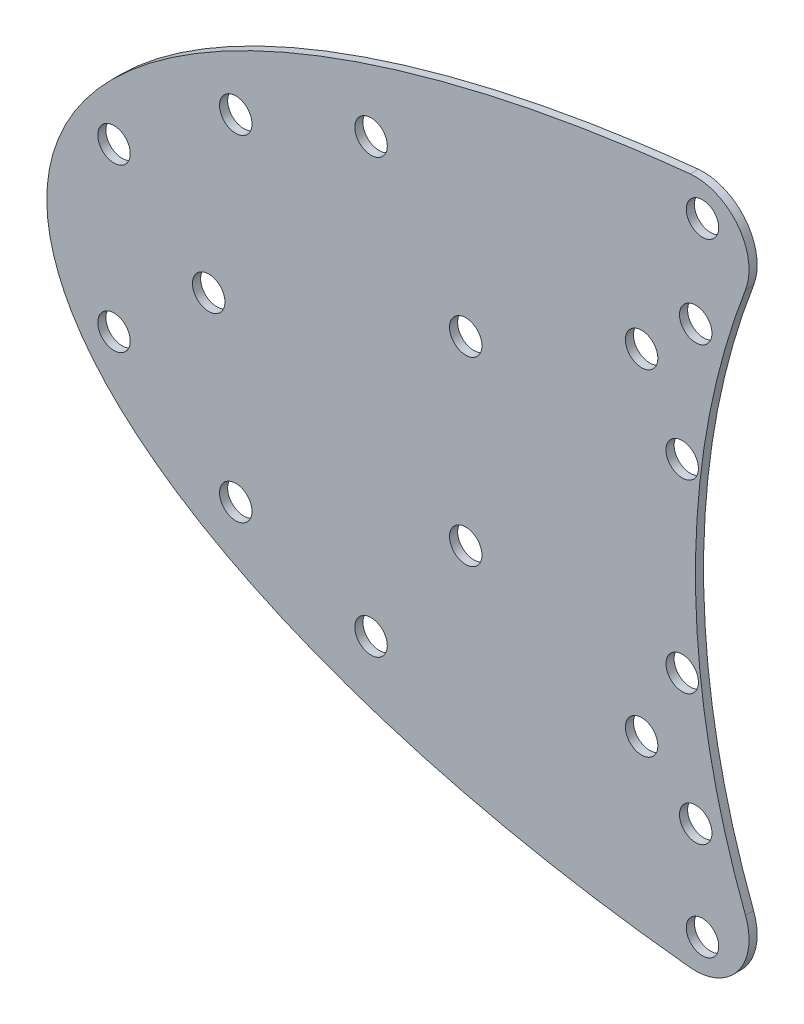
ISO-10303-21;
HEADER;
FILE_DESCRIPTION(('STEP AP214'),'2;1');
FILE_NAME('part.step','',(''),(''),'','','');
FILE_SCHEMA(('AUTOMOTIVE_DESIGN { 1 0 10303 214 1 1 1 1 }'));
ENDSEC;
DATA;
#1=APPLICATION_CONTEXT('core data for automotive mechanical design processes');
#2=APPLICATION_PROTOCOL_DEFINITION('international standard','automotive_design',2000,#1);
#3=PRODUCT_CONTEXT('',#1,'mechanical');
#4=PRODUCT('Part','Part','',(#3));
#5=PRODUCT_RELATED_PRODUCT_CATEGORY('part','',(#4));
#6=PRODUCT_DEFINITION_FORMATION('','',#4);
#7=PRODUCT_DEFINITION_CONTEXT('part definition',#1,'design');
#8=PRODUCT_DEFINITION('design','',#6,#7);
#9=PRODUCT_DEFINITION_SHAPE('','',#8);
#10=(LENGTH_UNIT() NAMED_UNIT(*) SI_UNIT(.MILLI.,.METRE.));
#11=(NAMED_UNIT(*) PLANE_ANGLE_UNIT() SI_UNIT($,.RADIAN.));
#12=(NAMED_UNIT(*) SI_UNIT($,.STERADIAN.) SOLID_ANGLE_UNIT());
#13=UNCERTAINTY_MEASURE_WITH_UNIT(LENGTH_MEASURE(1.E-05),#10,'distance_accuracy_value','');
#14=(GEOMETRIC_REPRESENTATION_CONTEXT(3) GLOBAL_UNCERTAINTY_ASSIGNED_CONTEXT((#13)) GLOBAL_UNIT_ASSIGNED_CONTEXT((#10,
#11,#12)) REPRESENTATION_CONTEXT('',''));
#15=CARTESIAN_POINT('',(0.,0.,0.));
#16=DIRECTION('',(0.,0.,1.));
#17=DIRECTION('',(1.,0.,0.));
#18=AXIS2_PLACEMENT_3D('',#15,#16,#17);
#19=CARTESIAN_POINT('',(-60.189081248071,107.21044141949,3.));
#20=DIRECTION('',(0.,0.,-1.));
#21=DIRECTION('',(-1.,0.,0.));
#22=AXIS2_PLACEMENT_3D('',#19,#20,#21);
#23=CYLINDRICAL_SURFACE('',#22,19.8953195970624);
#24=CARTESIAN_POINT('',(-60.189081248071,107.21044141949,0.));
#25=DIRECTION('',(0.,0.,-1.));
#26=DIRECTION('',(-1.,0.,0.));
#27=AXIS2_PLACEMENT_3D('',#24,#25,#26);
#28=CIRCLE('',#27,19.8953195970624);
#29=CARTESIAN_POINT('',(-62.0454838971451,127.018962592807,0.));
#30=VERTEX_POINT('',#29);
#31=CARTESIAN_POINT('',(-41.6075768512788,100.10048809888,0.));
#32=VERTEX_POINT('',#31);
#33=EDGE_CURVE('E101',#30,#32,#28,.T.);
#34=ORIENTED_EDGE('',*,*,#33,.F.);
#35=DIRECTION('',(0.,0.,-1.));
#36=VECTOR('',#35,1.);
#37=CARTESIAN_POINT('',(-62.0454838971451,127.018962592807,3.));
#38=LINE('',#37,#36);
#39=CARTESIAN_POINT('',(-62.0454838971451,127.018962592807,3.));
#40=VERTEX_POINT('',#39);
#41=EDGE_CURVE('E11',#40,#30,#38,.T.);
#42=ORIENTED_EDGE('',*,*,#41,.F.);
#43=CARTESIAN_POINT('',(-60.189081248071,107.21044141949,3.));
#44=DIRECTION('',(0.,0.,-1.));
#45=DIRECTION('',(-1.,0.,0.));
#46=AXIS2_PLACEMENT_3D('',#43,#44,#45);
#47=CIRCLE('',#46,19.8953195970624);
#48=CARTESIAN_POINT('',(-41.6075768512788,100.10048809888,3.));
#49=VERTEX_POINT('',#48);
#50=EDGE_CURVE('E93',#40,#49,#47,.T.);
#51=ORIENTED_EDGE('',*,*,#50,.T.);
#52=DIRECTION('',(0.,0.,-1.));
#53=VECTOR('',#52,1.);
#54=CARTESIAN_POINT('',(-41.6075768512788,100.10048809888,3.));
#55=LINE('',#54,#53);
#56=EDGE_CURVE('E38',#49,#32,#55,.T.);
#57=ORIENTED_EDGE('',*,*,#56,.T.);
#58=EDGE_LOOP('',(#34,#42,#51,#57));
#59=FACE_BOUND('',#58,.T.);
#60=ADVANCED_FACE('F35',(#59),#23,.T.);
#61=CARTESIAN_POINT('',(11.9501771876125,0.000386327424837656,3.));
#62=DIRECTION('',(0.,0.,-1.));
#63=DIRECTION('',(0.999999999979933,6.33512977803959E-06,0.));
#64=AXIS2_PLACEMENT_3D('',#61,#62,#63);
#65=ELLIPSE('',#64,311.78613987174,130.754687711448);
#66=DIRECTION('',(0.,0.,-1.));
#67=VECTOR('',#66,1.);
#68=SURFACE_OF_LINEAR_EXTRUSION('',#65,#67);
#69=CARTESIAN_POINT('',(11.9501771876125,0.000386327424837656,0.));
#70=DIRECTION('',(0.,0.,-1.));
#71=DIRECTION('',(0.999999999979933,6.33512977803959E-06,0.));
#72=AXIS2_PLACEMENT_3D('',#69,#70,#71);
#73=ELLIPSE('',#72,311.78613987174,130.754687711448);
#74=CARTESIAN_POINT('',(-62.0454838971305,-127.018962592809,0.));
#75=VERTEX_POINT('',#74);
#76=EDGE_CURVE('E95',#75,#30,#73,.T.);
#77=ORIENTED_EDGE('',*,*,#76,.F.);
#78=DIRECTION('',(0.,0.,-1.));
#79=VECTOR('',#78,1.);
#80=CARTESIAN_POINT('',(-62.0454838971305,-127.018962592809,3.));
#81=LINE('',#80,#79);
#82=CARTESIAN_POINT('',(-62.0454838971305,-127.018962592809,3.));
#83=VERTEX_POINT('',#82);
#84=EDGE_CURVE('E44',#83,#75,#81,.T.);
#85=ORIENTED_EDGE('',*,*,#84,.F.);
#86=EDGE_CURVE('E90',#83,#40,#65,.T.);
#87=ORIENTED_EDGE('',*,*,#86,.T.);
#88=ORIENTED_EDGE('',*,*,#41,.T.);
#89=EDGE_LOOP('',(#77,#85,#87,#88));
#90=FACE_BOUND('',#89,.T.);
#91=ADVANCED_FACE('F104',(#90),#68,.T.);
#92=CARTESIAN_POINT('',(-60.1890812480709,-107.21044141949,3.));
#93=DIRECTION('',(0.,0.,-1.));
#94=DIRECTION('',(-1.,0.,0.));
#95=AXIS2_PLACEMENT_3D('',#92,#93,#94);
#96=CYLINDRICAL_SURFACE('',#95,19.8953195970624);
#97=CARTESIAN_POINT('',(-60.1890812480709,-107.21044141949,0.));
#98=DIRECTION('',(0.,0.,-1.));
#99=DIRECTION('',(-1.,0.,0.));
#100=AXIS2_PLACEMENT_3D('',#97,#98,#99);
#101=CIRCLE('',#100,19.8953195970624);
#102=CARTESIAN_POINT('',(-41.6075768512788,-100.10048809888,0.));
#103=VERTEX_POINT('',#102);
#104=EDGE_CURVE('E85',#103,#75,#101,.T.);
#105=ORIENTED_EDGE('',*,*,#104,.F.);
#106=DIRECTION('',(0.,0.,-1.));
#107=VECTOR('',#106,1.);
#108=CARTESIAN_POINT('',(-41.6075768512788,-100.10048809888,3.));
#109=LINE('',#108,#107);
#110=CARTESIAN_POINT('',(-41.6075768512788,-100.10048809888,3.));
#111=VERTEX_POINT('',#110);
#112=EDGE_CURVE('E80',#111,#103,#109,.T.);
#113=ORIENTED_EDGE('',*,*,#112,.F.);
#114=CARTESIAN_POINT('',(-60.1890812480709,-107.21044141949,3.));
#115=DIRECTION('',(0.,0.,-1.));
#116=DIRECTION('',(-1.,0.,0.));
#117=AXIS2_PLACEMENT_3D('',#114,#115,#116);
#118=CIRCLE('',#117,19.8953195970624);
#119=EDGE_CURVE('E83',#111,#83,#118,.T.);
#120=ORIENTED_EDGE('',*,*,#119,.T.);
#121=ORIENTED_EDGE('',*,*,#84,.T.);
#122=EDGE_LOOP('',(#105,#113,#120,#121));
#123=FACE_BOUND('',#122,.T.);
#124=ADVANCED_FACE('F82',(#123),#96,.T.);
#125=CARTESIAN_POINT('',(220.,0.,3.));
#126=DIRECTION('',(0.,0.,-1.));
#127=DIRECTION('',(-1.,0.,0.));
#128=AXIS2_PLACEMENT_3D('',#125,#126,#127);
#129=CYLINDRICAL_SURFACE('',#128,280.104680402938);
#130=CARTESIAN_POINT('',(220.,0.,0.));
#131=DIRECTION('',(0.,0.,1.));
#132=DIRECTION('',(1.,0.,0.));
#133=AXIS2_PLACEMENT_3D('',#130,#131,#132);
#134=CIRCLE('',#133,280.104680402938);
#135=EDGE_CURVE('E122',#32,#103,#134,.T.);
#136=ORIENTED_EDGE('',*,*,#135,.F.);
#137=ORIENTED_EDGE('',*,*,#56,.F.);
#138=CARTESIAN_POINT('',(220.,0.,3.));
#139=DIRECTION('',(0.,0.,1.));
#140=DIRECTION('',(1.,0.,0.));
#141=AXIS2_PLACEMENT_3D('',#138,#139,#140);
#142=CIRCLE('',#141,280.104680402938);
#143=EDGE_CURVE('E89',#49,#111,#142,.T.);
#144=ORIENTED_EDGE('',*,*,#143,.T.);
#145=ORIENTED_EDGE('',*,*,#112,.T.);
#146=EDGE_LOOP('',(#136,#137,#144,#145));
#147=FACE_BOUND('',#146,.T.);
#148=ADVANCED_FACE('F92',(#147),#129,.F.);
#149=CARTESIAN_POINT('',(11.9501771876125,0.000386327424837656,3.));
#150=DIRECTION('',(0.,0.,-1.));
#151=DIRECTION('',(-1.,0.,0.));
#152=AXIS2_PLACEMENT_3D('',#149,#150,#151);
#153=PLANE('',#152);
#154=CARTESIAN_POINT('',(-57.5,115.,3.));
#155=DIRECTION('',(0.,0.,-1.));
#156=DIRECTION('',(1.,0.,0.));
#157=AXIS2_PLACEMENT_3D('',#154,#155,#156);
#158=CIRCLE('',#157,6.00000000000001);
#159=CARTESIAN_POINT('',(-51.5,115.,3.));
#160=VERTEX_POINT('',#159);
#161=EDGE_CURVE('E265',#160,#160,#158,.T.);
#162=ORIENTED_EDGE('',*,*,#161,.T.);
#163=EDGE_LOOP('',(#162));
#164=FACE_BOUND('',#163,.T.);
#165=CARTESIAN_POINT('',(-57.5,-115.,3.));
#166=DIRECTION('',(0.,0.,-1.));
#167=DIRECTION('',(1.,0.,0.));
#168=AXIS2_PLACEMENT_3D('',#165,#166,#167);
#169=CIRCLE('',#168,6.00000000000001);
#170=CARTESIAN_POINT('',(-51.5,-115.,3.));
#171=VERTEX_POINT('',#170);
#172=EDGE_CURVE('E261',#171,#171,#169,.T.);
#173=ORIENTED_EDGE('',*,*,#172,.T.);
#174=EDGE_LOOP('',(#173));
#175=FACE_BOUND('',#174,.T.);
#176=CARTESIAN_POINT('',(-80.,-62.,3.));
#177=DIRECTION('',(0.,0.,-1.));
#178=DIRECTION('',(1.,0.,0.));
#179=AXIS2_PLACEMENT_3D('',#176,#177,#178);
#180=CIRCLE('',#179,6.00000000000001);
#181=CARTESIAN_POINT('',(-74.,-62.,3.));
#182=VERTEX_POINT('',#181);
#183=EDGE_CURVE('E257',#182,#182,#180,.T.);
#184=ORIENTED_EDGE('',*,*,#183,.T.);
#185=EDGE_LOOP('',(#184));
#186=FACE_BOUND('',#185,.T.);
#187=CARTESIAN_POINT('',(-60.0000000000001,-80.,3.));
#188=DIRECTION('',(0.,0.,-1.));
#189=DIRECTION('',(1.,0.,0.));
#190=AXIS2_PLACEMENT_3D('',#187,#188,#189);
#191=CIRCLE('',#190,6.00000000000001);
#192=CARTESIAN_POINT('',(-54.0000000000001,-80.,3.));
#193=VERTEX_POINT('',#192);
#194=EDGE_CURVE('E253',#193,#193,#191,.T.);
#195=ORIENTED_EDGE('',*,*,#194,.T.);
#196=EDGE_LOOP('',(#195));
#197=FACE_BOUND('',#196,.T.);
#198=CARTESIAN_POINT('',(-60.0000000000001,80.,3.));
#199=DIRECTION('',(0.,0.,-1.));
#200=DIRECTION('',(1.,0.,0.));
#201=AXIS2_PLACEMENT_3D('',#198,#199,#200);
#202=CIRCLE('',#201,6.00000000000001);
#203=CARTESIAN_POINT('',(-54.0000000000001,80.,3.));
#204=VERTEX_POINT('',#203);
#205=EDGE_CURVE('E249',#204,#204,#202,.T.);
#206=ORIENTED_EDGE('',*,*,#205,.T.);
#207=EDGE_LOOP('',(#206));
#208=FACE_BOUND('',#207,.T.);
#209=CARTESIAN_POINT('',(-80.,62.,3.));
#210=DIRECTION('',(0.,0.,-1.));
#211=DIRECTION('',(1.,0.,0.));
#212=AXIS2_PLACEMENT_3D('',#209,#210,#211);
#213=CIRCLE('',#212,6.00000000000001);
#214=CARTESIAN_POINT('',(-74.,62.,3.));
#215=VERTEX_POINT('',#214);
#216=EDGE_CURVE('E245',#215,#215,#213,.T.);
#217=ORIENTED_EDGE('',*,*,#216,.T.);
#218=EDGE_LOOP('',(#217));
#219=FACE_BOUND('',#218,.T.);
#220=CARTESIAN_POINT('',(-65.,-34.2,3.));
#221=DIRECTION('',(0.,0.,-1.));
#222=DIRECTION('',(1.,0.,0.));
#223=AXIS2_PLACEMENT_3D('',#220,#221,#222);
#224=CIRCLE('',#223,6.00000000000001);
#225=CARTESIAN_POINT('',(-59.,-34.2,3.));
#226=VERTEX_POINT('',#225);
#227=EDGE_CURVE('E241',#226,#226,#224,.T.);
#228=ORIENTED_EDGE('',*,*,#227,.T.);
#229=EDGE_LOOP('',(#228));
#230=FACE_BOUND('',#229,.T.);
#231=CARTESIAN_POINT('',(-145.,33.5,3.));
#232=DIRECTION('',(0.,0.,-1.));
#233=DIRECTION('',(1.,0.,0.));
#234=AXIS2_PLACEMENT_3D('',#231,#232,#233);
#235=CIRCLE('',#234,6.00000000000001);
#236=CARTESIAN_POINT('',(-139.,33.5,3.));
#237=VERTEX_POINT('',#236);
#238=EDGE_CURVE('E237',#237,#237,#235,.T.);
#239=ORIENTED_EDGE('',*,*,#238,.T.);
#240=EDGE_LOOP('',(#239));
#241=FACE_BOUND('',#240,.T.);
#242=CARTESIAN_POINT('',(-65.,34.2,3.));
#243=DIRECTION('',(0.,0.,-1.));
#244=DIRECTION('',(1.,0.,0.));
#245=AXIS2_PLACEMENT_3D('',#242,#243,#244);
#246=CIRCLE('',#245,6.00000000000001);
#247=CARTESIAN_POINT('',(-59.,34.2,3.));
#248=VERTEX_POINT('',#247);
#249=EDGE_CURVE('E233',#248,#248,#246,.T.);
#250=ORIENTED_EDGE('',*,*,#249,.T.);
#251=EDGE_LOOP('',(#250));
#252=FACE_BOUND('',#251,.T.);
#253=CARTESIAN_POINT('',(-145.,-33.5,3.));
#254=DIRECTION('',(0.,0.,-1.));
#255=DIRECTION('',(1.,0.,0.));
#256=AXIS2_PLACEMENT_3D('',#253,#254,#255);
#257=CIRCLE('',#256,6.00000000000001);
#258=CARTESIAN_POINT('',(-139.,-33.5,3.));
#259=VERTEX_POINT('',#258);
#260=EDGE_CURVE('E229',#259,#259,#257,.T.);
#261=ORIENTED_EDGE('',*,*,#260,.T.);
#262=EDGE_LOOP('',(#261));
#263=FACE_BOUND('',#262,.T.);
#264=CARTESIAN_POINT('',(-180.,-80.,3.));
#265=DIRECTION('',(0.,0.,-1.));
#266=DIRECTION('',(1.,0.,0.));
#267=AXIS2_PLACEMENT_3D('',#264,#265,#266);
#268=CIRCLE('',#267,6.00000000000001);
#269=CARTESIAN_POINT('',(-174.,-80.,3.));
#270=VERTEX_POINT('',#269);
#271=EDGE_CURVE('E225',#270,#270,#268,.T.);
#272=ORIENTED_EDGE('',*,*,#271,.T.);
#273=EDGE_LOOP('',(#272));
#274=FACE_BOUND('',#273,.T.);
#275=CARTESIAN_POINT('',(-180.,80.,3.));
#276=DIRECTION('',(0.,0.,-1.));
#277=DIRECTION('',(1.,0.,0.));
#278=AXIS2_PLACEMENT_3D('',#275,#276,#277);
#279=CIRCLE('',#278,6.00000000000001);
#280=CARTESIAN_POINT('',(-174.,80.,3.));
#281=VERTEX_POINT('',#280);
#282=EDGE_CURVE('E221',#281,#281,#279,.T.);
#283=ORIENTED_EDGE('',*,*,#282,.T.);
#284=EDGE_LOOP('',(#283));
#285=FACE_BOUND('',#284,.T.);
#286=CARTESIAN_POINT('',(-230.,-62.,3.));
#287=DIRECTION('',(0.,0.,-1.));
#288=DIRECTION('',(1.,0.,0.));
#289=AXIS2_PLACEMENT_3D('',#286,#287,#288);
#290=CIRCLE('',#289,6.00000000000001);
#291=CARTESIAN_POINT('',(-224.,-62.,3.));
#292=VERTEX_POINT('',#291);
#293=EDGE_CURVE('E217',#292,#292,#290,.T.);
#294=ORIENTED_EDGE('',*,*,#293,.T.);
#295=EDGE_LOOP('',(#294));
#296=FACE_BOUND('',#295,.T.);
#297=CARTESIAN_POINT('',(-230.,62.,3.));
#298=DIRECTION('',(0.,0.,-1.));
#299=DIRECTION('',(1.,0.,0.));
#300=AXIS2_PLACEMENT_3D('',#297,#298,#299);
#301=CIRCLE('',#300,6.00000000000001);
#302=CARTESIAN_POINT('',(-224.,62.,3.));
#303=VERTEX_POINT('',#302);
#304=EDGE_CURVE('E213',#303,#303,#301,.T.);
#305=ORIENTED_EDGE('',*,*,#304,.T.);
#306=EDGE_LOOP('',(#305));
#307=FACE_BOUND('',#306,.T.);
#308=CARTESIAN_POINT('',(-240.,0.,3.));
#309=DIRECTION('',(0.,0.,-1.));
#310=DIRECTION('',(1.,0.,0.));
#311=AXIS2_PLACEMENT_3D('',#308,#309,#310);
#312=CIRCLE('',#311,6.00000000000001);
#313=CARTESIAN_POINT('',(-234.,0.,3.));
#314=VERTEX_POINT('',#313);
#315=EDGE_CURVE('E210',#314,#314,#312,.T.);
#316=ORIENTED_EDGE('',*,*,#315,.T.);
#317=EDGE_LOOP('',(#316));
#318=FACE_BOUND('',#317,.T.);
#319=CARTESIAN_POINT('',(-275.,30.,3.));
#320=DIRECTION('',(0.,0.,-1.));
#321=DIRECTION('',(1.,0.,0.));
#322=AXIS2_PLACEMENT_3D('',#319,#320,#321);
#323=CIRCLE('',#322,6.00000000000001);
#324=CARTESIAN_POINT('',(-269.,30.,3.));
#325=VERTEX_POINT('',#324);
#326=EDGE_CURVE('E204',#325,#325,#323,.T.);
#327=ORIENTED_EDGE('',*,*,#326,.T.);
#328=EDGE_LOOP('',(#327));
#329=FACE_BOUND('',#328,.T.);
#330=CARTESIAN_POINT('',(-275.,-30.,3.));
#331=DIRECTION('',(0.,0.,-1.));
#332=DIRECTION('',(1.,0.,0.));
#333=AXIS2_PLACEMENT_3D('',#330,#331,#332);
#334=CIRCLE('',#333,6.00000000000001);
#335=CARTESIAN_POINT('',(-269.,-30.,3.));
#336=VERTEX_POINT('',#335);
#337=EDGE_CURVE('E123',#336,#336,#334,.T.);
#338=ORIENTED_EDGE('',*,*,#337,.T.);
#339=EDGE_LOOP('',(#338));
#340=FACE_BOUND('',#339,.T.);
#341=ORIENTED_EDGE('',*,*,#50,.F.);
#342=ORIENTED_EDGE('',*,*,#86,.F.);
#343=ORIENTED_EDGE('',*,*,#119,.F.);
#344=ORIENTED_EDGE('',*,*,#143,.F.);
#345=EDGE_LOOP('',(#341,#342,#343,#344));
#346=FACE_BOUND('',#345,.T.);
#347=ADVANCED_FACE('F88',(#164,#175,#186,#197,#208,#219,#230,#241,#252,#263,#274,#285,#296,#307,
#318,#329,#340,#346),#153,.F.);
#348=CARTESIAN_POINT('',(11.9501771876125,0.000386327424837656,0.));
#349=DIRECTION('',(0.,0.,-1.));
#350=DIRECTION('',(-1.,0.,0.));
#351=AXIS2_PLACEMENT_3D('',#348,#349,#350);
#352=PLANE('',#351);
#353=CARTESIAN_POINT('',(-57.5,115.,0.));
#354=DIRECTION('',(0.,0.,-1.));
#355=DIRECTION('',(1.,0.,0.));
#356=AXIS2_PLACEMENT_3D('',#353,#354,#355);
#357=CIRCLE('',#356,6.00000000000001);
#358=CARTESIAN_POINT('',(-51.5,115.,0.));
#359=VERTEX_POINT('',#358);
#360=EDGE_CURVE('E139',#359,#359,#357,.T.);
#361=ORIENTED_EDGE('',*,*,#360,.F.);
#362=EDGE_LOOP('',(#361));
#363=FACE_BOUND('',#362,.T.);
#364=CARTESIAN_POINT('',(-57.5,-115.,0.));
#365=DIRECTION('',(0.,0.,-1.));
#366=DIRECTION('',(1.,0.,0.));
#367=AXIS2_PLACEMENT_3D('',#364,#365,#366);
#368=CIRCLE('',#367,6.00000000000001);
#369=CARTESIAN_POINT('',(-51.5,-115.,0.));
#370=VERTEX_POINT('',#369);
#371=EDGE_CURVE('E143',#370,#370,#368,.T.);
#372=ORIENTED_EDGE('',*,*,#371,.F.);
#373=EDGE_LOOP('',(#372));
#374=FACE_BOUND('',#373,.T.);
#375=CARTESIAN_POINT('',(-80.,-62.,0.));
#376=DIRECTION('',(0.,0.,-1.));
#377=DIRECTION('',(1.,0.,0.));
#378=AXIS2_PLACEMENT_3D('',#375,#376,#377);
#379=CIRCLE('',#378,6.00000000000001);
#380=CARTESIAN_POINT('',(-74.,-62.,0.));
#381=VERTEX_POINT('',#380);
#382=EDGE_CURVE('E147',#381,#381,#379,.T.);
#383=ORIENTED_EDGE('',*,*,#382,.F.);
#384=EDGE_LOOP('',(#383));
#385=FACE_BOUND('',#384,.T.);
#386=CARTESIAN_POINT('',(-60.0000000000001,-80.,0.));
#387=DIRECTION('',(0.,0.,-1.));
#388=DIRECTION('',(1.,0.,0.));
#389=AXIS2_PLACEMENT_3D('',#386,#387,#388);
#390=CIRCLE('',#389,6.00000000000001);
#391=CARTESIAN_POINT('',(-54.0000000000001,-80.,0.));
#392=VERTEX_POINT('',#391);
#393=EDGE_CURVE('E151',#392,#392,#390,.T.);
#394=ORIENTED_EDGE('',*,*,#393,.F.);
#395=EDGE_LOOP('',(#394));
#396=FACE_BOUND('',#395,.T.);
#397=CARTESIAN_POINT('',(-60.0000000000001,80.,0.));
#398=DIRECTION('',(0.,0.,-1.));
#399=DIRECTION('',(1.,0.,0.));
#400=AXIS2_PLACEMENT_3D('',#397,#398,#399);
#401=CIRCLE('',#400,6.00000000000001);
#402=CARTESIAN_POINT('',(-54.0000000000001,80.,0.));
#403=VERTEX_POINT('',#402);
#404=EDGE_CURVE('E155',#403,#403,#401,.T.);
#405=ORIENTED_EDGE('',*,*,#404,.F.);
#406=EDGE_LOOP('',(#405));
#407=FACE_BOUND('',#406,.T.);
#408=CARTESIAN_POINT('',(-80.,62.,0.));
#409=DIRECTION('',(0.,0.,-1.));
#410=DIRECTION('',(1.,0.,0.));
#411=AXIS2_PLACEMENT_3D('',#408,#409,#410);
#412=CIRCLE('',#411,6.00000000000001);
#413=CARTESIAN_POINT('',(-74.,62.,0.));
#414=VERTEX_POINT('',#413);
#415=EDGE_CURVE('E159',#414,#414,#412,.T.);
#416=ORIENTED_EDGE('',*,*,#415,.F.);
#417=EDGE_LOOP('',(#416));
#418=FACE_BOUND('',#417,.T.);
#419=CARTESIAN_POINT('',(-65.,-34.2,0.));
#420=DIRECTION('',(0.,0.,-1.));
#421=DIRECTION('',(1.,0.,0.));
#422=AXIS2_PLACEMENT_3D('',#419,#420,#421);
#423=CIRCLE('',#422,6.00000000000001);
#424=CARTESIAN_POINT('',(-59.,-34.2,0.));
#425=VERTEX_POINT('',#424);
#426=EDGE_CURVE('E163',#425,#425,#423,.T.);
#427=ORIENTED_EDGE('',*,*,#426,.F.);
#428=EDGE_LOOP('',(#427));
#429=FACE_BOUND('',#428,.T.);
#430=CARTESIAN_POINT('',(-145.,33.5,0.));
#431=DIRECTION('',(0.,0.,-1.));
#432=DIRECTION('',(1.,0.,0.));
#433=AXIS2_PLACEMENT_3D('',#430,#431,#432);
#434=CIRCLE('',#433,6.00000000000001);
#435=CARTESIAN_POINT('',(-139.,33.5,0.));
#436=VERTEX_POINT('',#435);
#437=EDGE_CURVE('E167',#436,#436,#434,.T.);
#438=ORIENTED_EDGE('',*,*,#437,.F.);
#439=EDGE_LOOP('',(#438));
#440=FACE_BOUND('',#439,.T.);
#441=CARTESIAN_POINT('',(-65.,34.2,0.));
#442=DIRECTION('',(0.,0.,-1.));
#443=DIRECTION('',(1.,0.,0.));
#444=AXIS2_PLACEMENT_3D('',#441,#442,#443);
#445=CIRCLE('',#444,6.00000000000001);
#446=CARTESIAN_POINT('',(-59.,34.2,0.));
#447=VERTEX_POINT('',#446);
#448=EDGE_CURVE('E171',#447,#447,#445,.T.);
#449=ORIENTED_EDGE('',*,*,#448,.F.);
#450=EDGE_LOOP('',(#449));
#451=FACE_BOUND('',#450,.T.);
#452=CARTESIAN_POINT('',(-145.,-33.5,0.));
#453=DIRECTION('',(0.,0.,-1.));
#454=DIRECTION('',(1.,0.,0.));
#455=AXIS2_PLACEMENT_3D('',#452,#453,#454);
#456=CIRCLE('',#455,6.00000000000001);
#457=CARTESIAN_POINT('',(-139.,-33.5,0.));
#458=VERTEX_POINT('',#457);
#459=EDGE_CURVE('E175',#458,#458,#456,.T.);
#460=ORIENTED_EDGE('',*,*,#459,.F.);
#461=EDGE_LOOP('',(#460));
#462=FACE_BOUND('',#461,.T.);
#463=CARTESIAN_POINT('',(-180.,-80.,0.));
#464=DIRECTION('',(0.,0.,-1.));
#465=DIRECTION('',(1.,0.,0.));
#466=AXIS2_PLACEMENT_3D('',#463,#464,#465);
#467=CIRCLE('',#466,6.00000000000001);
#468=CARTESIAN_POINT('',(-174.,-80.,0.));
#469=VERTEX_POINT('',#468);
#470=EDGE_CURVE('E179',#469,#469,#467,.T.);
#471=ORIENTED_EDGE('',*,*,#470,.F.);
#472=EDGE_LOOP('',(#471));
#473=FACE_BOUND('',#472,.T.);
#474=CARTESIAN_POINT('',(-180.,80.,0.));
#475=DIRECTION('',(0.,0.,-1.));
#476=DIRECTION('',(1.,0.,0.));
#477=AXIS2_PLACEMENT_3D('',#474,#475,#476);
#478=CIRCLE('',#477,6.00000000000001);
#479=CARTESIAN_POINT('',(-174.,80.,0.));
#480=VERTEX_POINT('',#479);
#481=EDGE_CURVE('E183',#480,#480,#478,.T.);
#482=ORIENTED_EDGE('',*,*,#481,.F.);
#483=EDGE_LOOP('',(#482));
#484=FACE_BOUND('',#483,.T.);
#485=CARTESIAN_POINT('',(-230.,-62.,0.));
#486=DIRECTION('',(0.,0.,-1.));
#487=DIRECTION('',(1.,0.,0.));
#488=AXIS2_PLACEMENT_3D('',#485,#486,#487);
#489=CIRCLE('',#488,6.00000000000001);
#490=CARTESIAN_POINT('',(-224.,-62.,0.));
#491=VERTEX_POINT('',#490);
#492=EDGE_CURVE('E187',#491,#491,#489,.T.);
#493=ORIENTED_EDGE('',*,*,#492,.F.);
#494=EDGE_LOOP('',(#493));
#495=FACE_BOUND('',#494,.T.);
#496=CARTESIAN_POINT('',(-230.,62.,0.));
#497=DIRECTION('',(0.,0.,-1.));
#498=DIRECTION('',(1.,0.,0.));
#499=AXIS2_PLACEMENT_3D('',#496,#497,#498);
#500=CIRCLE('',#499,6.00000000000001);
#501=CARTESIAN_POINT('',(-224.,62.,0.));
#502=VERTEX_POINT('',#501);
#503=EDGE_CURVE('E191',#502,#502,#500,.T.);
#504=ORIENTED_EDGE('',*,*,#503,.F.);
#505=EDGE_LOOP('',(#504));
#506=FACE_BOUND('',#505,.T.);
#507=CARTESIAN_POINT('',(-240.,0.,0.));
#508=DIRECTION('',(0.,0.,-1.));
#509=DIRECTION('',(1.,0.,0.));
#510=AXIS2_PLACEMENT_3D('',#507,#508,#509);
#511=CIRCLE('',#510,6.00000000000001);
#512=CARTESIAN_POINT('',(-234.,0.,0.));
#513=VERTEX_POINT('',#512);
#514=EDGE_CURVE('E195',#513,#513,#511,.T.);
#515=ORIENTED_EDGE('',*,*,#514,.F.);
#516=EDGE_LOOP('',(#515));
#517=FACE_BOUND('',#516,.T.);
#518=CARTESIAN_POINT('',(-275.,30.,0.));
#519=DIRECTION('',(0.,0.,-1.));
#520=DIRECTION('',(1.,0.,0.));
#521=AXIS2_PLACEMENT_3D('',#518,#519,#520);
#522=CIRCLE('',#521,6.00000000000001);
#523=CARTESIAN_POINT('',(-269.,30.,0.));
#524=VERTEX_POINT('',#523);
#525=EDGE_CURVE('E199',#524,#524,#522,.T.);
#526=ORIENTED_EDGE('',*,*,#525,.F.);
#527=EDGE_LOOP('',(#526));
#528=FACE_BOUND('',#527,.T.);
#529=CARTESIAN_POINT('',(-275.,-30.,0.));
#530=DIRECTION('',(0.,0.,-1.));
#531=DIRECTION('',(1.,0.,0.));
#532=AXIS2_PLACEMENT_3D('',#529,#530,#531);
#533=CIRCLE('',#532,6.00000000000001);
#534=CARTESIAN_POINT('',(-269.,-30.,0.));
#535=VERTEX_POINT('',#534);
#536=EDGE_CURVE('E202',#535,#535,#533,.T.);
#537=ORIENTED_EDGE('',*,*,#536,.F.);
#538=EDGE_LOOP('',(#537));
#539=FACE_BOUND('',#538,.T.);
#540=ORIENTED_EDGE('',*,*,#33,.T.);
#541=ORIENTED_EDGE('',*,*,#135,.T.);
#542=ORIENTED_EDGE('',*,*,#104,.T.);
#543=ORIENTED_EDGE('',*,*,#76,.T.);
#544=EDGE_LOOP('',(#540,#541,#542,#543));
#545=FACE_BOUND('',#544,.T.);
#546=ADVANCED_FACE('F108',(#363,#374,#385,#396,#407,#418,#429,#440,#451,#462,#473,#484,#495,
#506,#517,#528,#539,#545),#352,.T.);
#547=CARTESIAN_POINT('',(-275.,-30.,3.));
#548=DIRECTION('',(0.,0.,-1.));
#549=DIRECTION('',(-1.,0.,0.));
#550=AXIS2_PLACEMENT_3D('',#547,#548,#549);
#551=CYLINDRICAL_SURFACE('',#550,6.00000000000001);
#552=ORIENTED_EDGE('',*,*,#337,.F.);
#553=EDGE_LOOP('',(#552));
#554=FACE_BOUND('',#553,.T.);
#555=ORIENTED_EDGE('',*,*,#536,.T.);
#556=EDGE_LOOP('',(#555));
#557=FACE_BOUND('',#556,.T.);
#558=ADVANCED_FACE('F128',(#554,#557),#551,.F.);
#559=CARTESIAN_POINT('',(-275.,30.,3.));
#560=DIRECTION('',(0.,0.,-1.));
#561=DIRECTION('',(-1.,0.,0.));
#562=AXIS2_PLACEMENT_3D('',#559,#560,#561);
#563=CYLINDRICAL_SURFACE('',#562,6.00000000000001);
#564=ORIENTED_EDGE('',*,*,#326,.F.);
#565=EDGE_LOOP('',(#564));
#566=FACE_BOUND('',#565,.T.);
#567=ORIENTED_EDGE('',*,*,#525,.T.);
#568=EDGE_LOOP('',(#567));
#569=FACE_BOUND('',#568,.T.);
#570=ADVANCED_FACE('F133',(#566,#569),#563,.F.);
#571=CARTESIAN_POINT('',(-240.,0.,3.));
#572=DIRECTION('',(0.,0.,-1.));
#573=DIRECTION('',(-1.,0.,0.));
#574=AXIS2_PLACEMENT_3D('',#571,#572,#573);
#575=CYLINDRICAL_SURFACE('',#574,6.00000000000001);
#576=ORIENTED_EDGE('',*,*,#315,.F.);
#577=EDGE_LOOP('',(#576));
#578=FACE_BOUND('',#577,.T.);
#579=ORIENTED_EDGE('',*,*,#514,.T.);
#580=EDGE_LOOP('',(#579));
#581=FACE_BOUND('',#580,.T.);
#582=ADVANCED_FACE('F331',(#578,#581),#575,.F.);
#583=CARTESIAN_POINT('',(-230.,62.,3.));
#584=DIRECTION('',(0.,0.,-1.));
#585=DIRECTION('',(-1.,0.,0.));
#586=AXIS2_PLACEMENT_3D('',#583,#584,#585);
#587=CYLINDRICAL_SURFACE('',#586,6.00000000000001);
#588=ORIENTED_EDGE('',*,*,#304,.F.);
#589=EDGE_LOOP('',(#588));
#590=FACE_BOUND('',#589,.T.);
#591=ORIENTED_EDGE('',*,*,#503,.T.);
#592=EDGE_LOOP('',(#591));
#593=FACE_BOUND('',#592,.T.);
#594=ADVANCED_FACE('F327',(#590,#593),#587,.F.);
#595=CARTESIAN_POINT('',(-230.,-62.,3.));
#596=DIRECTION('',(0.,0.,-1.));
#597=DIRECTION('',(-1.,0.,0.));
#598=AXIS2_PLACEMENT_3D('',#595,#596,#597);
#599=CYLINDRICAL_SURFACE('',#598,6.00000000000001);
#600=ORIENTED_EDGE('',*,*,#293,.F.);
#601=EDGE_LOOP('',(#600));
#602=FACE_BOUND('',#601,.T.);
#603=ORIENTED_EDGE('',*,*,#492,.T.);
#604=EDGE_LOOP('',(#603));
#605=FACE_BOUND('',#604,.T.);
#606=ADVANCED_FACE('F323',(#602,#605),#599,.F.);
#607=CARTESIAN_POINT('',(-180.,80.,3.));
#608=DIRECTION('',(0.,0.,-1.));
#609=DIRECTION('',(-1.,0.,0.));
#610=AXIS2_PLACEMENT_3D('',#607,#608,#609);
#611=CYLINDRICAL_SURFACE('',#610,6.00000000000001);
#612=ORIENTED_EDGE('',*,*,#282,.F.);
#613=EDGE_LOOP('',(#612));
#614=FACE_BOUND('',#613,.T.);
#615=ORIENTED_EDGE('',*,*,#481,.T.);
#616=EDGE_LOOP('',(#615));
#617=FACE_BOUND('',#616,.T.);
#618=ADVANCED_FACE('F319',(#614,#617),#611,.F.);
#619=CARTESIAN_POINT('',(-180.,-80.,3.));
#620=DIRECTION('',(0.,0.,-1.));
#621=DIRECTION('',(-1.,0.,0.));
#622=AXIS2_PLACEMENT_3D('',#619,#620,#621);
#623=CYLINDRICAL_SURFACE('',#622,6.00000000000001);
#624=ORIENTED_EDGE('',*,*,#271,.F.);
#625=EDGE_LOOP('',(#624));
#626=FACE_BOUND('',#625,.T.);
#627=ORIENTED_EDGE('',*,*,#470,.T.);
#628=EDGE_LOOP('',(#627));
#629=FACE_BOUND('',#628,.T.);
#630=ADVANCED_FACE('F315',(#626,#629),#623,.F.);
#631=CARTESIAN_POINT('',(-145.,-33.5,3.));
#632=DIRECTION('',(0.,0.,-1.));
#633=DIRECTION('',(-1.,0.,0.));
#634=AXIS2_PLACEMENT_3D('',#631,#632,#633);
#635=CYLINDRICAL_SURFACE('',#634,6.00000000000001);
#636=ORIENTED_EDGE('',*,*,#260,.F.);
#637=EDGE_LOOP('',(#636));
#638=FACE_BOUND('',#637,.T.);
#639=ORIENTED_EDGE('',*,*,#459,.T.);
#640=EDGE_LOOP('',(#639));
#641=FACE_BOUND('',#640,.T.);
#642=ADVANCED_FACE('F311',(#638,#641),#635,.F.);
#643=CARTESIAN_POINT('',(-65.,34.2,3.));
#644=DIRECTION('',(0.,0.,-1.));
#645=DIRECTION('',(-1.,0.,0.));
#646=AXIS2_PLACEMENT_3D('',#643,#644,#645);
#647=CYLINDRICAL_SURFACE('',#646,6.00000000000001);
#648=ORIENTED_EDGE('',*,*,#249,.F.);
#649=EDGE_LOOP('',(#648));
#650=FACE_BOUND('',#649,.T.);
#651=ORIENTED_EDGE('',*,*,#448,.T.);
#652=EDGE_LOOP('',(#651));
#653=FACE_BOUND('',#652,.T.);
#654=ADVANCED_FACE('F307',(#650,#653),#647,.F.);
#655=CARTESIAN_POINT('',(-145.,33.5,3.));
#656=DIRECTION('',(0.,0.,-1.));
#657=DIRECTION('',(-1.,0.,0.));
#658=AXIS2_PLACEMENT_3D('',#655,#656,#657);
#659=CYLINDRICAL_SURFACE('',#658,6.00000000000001);
#660=ORIENTED_EDGE('',*,*,#238,.F.);
#661=EDGE_LOOP('',(#660));
#662=FACE_BOUND('',#661,.T.);
#663=ORIENTED_EDGE('',*,*,#437,.T.);
#664=EDGE_LOOP('',(#663));
#665=FACE_BOUND('',#664,.T.);
#666=ADVANCED_FACE('F303',(#662,#665),#659,.F.);
#667=CARTESIAN_POINT('',(-65.,-34.2,3.));
#668=DIRECTION('',(0.,0.,-1.));
#669=DIRECTION('',(-1.,0.,0.));
#670=AXIS2_PLACEMENT_3D('',#667,#668,#669);
#671=CYLINDRICAL_SURFACE('',#670,6.00000000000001);
#672=ORIENTED_EDGE('',*,*,#227,.F.);
#673=EDGE_LOOP('',(#672));
#674=FACE_BOUND('',#673,.T.);
#675=ORIENTED_EDGE('',*,*,#426,.T.);
#676=EDGE_LOOP('',(#675));
#677=FACE_BOUND('',#676,.T.);
#678=ADVANCED_FACE('F299',(#674,#677),#671,.F.);
#679=CARTESIAN_POINT('',(-80.,62.,3.));
#680=DIRECTION('',(0.,0.,-1.));
#681=DIRECTION('',(-1.,0.,0.));
#682=AXIS2_PLACEMENT_3D('',#679,#680,#681);
#683=CYLINDRICAL_SURFACE('',#682,6.00000000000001);
#684=ORIENTED_EDGE('',*,*,#216,.F.);
#685=EDGE_LOOP('',(#684));
#686=FACE_BOUND('',#685,.T.);
#687=ORIENTED_EDGE('',*,*,#415,.T.);
#688=EDGE_LOOP('',(#687));
#689=FACE_BOUND('',#688,.T.);
#690=ADVANCED_FACE('F295',(#686,#689),#683,.F.);
#691=CARTESIAN_POINT('',(-60.0000000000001,80.,3.));
#692=DIRECTION('',(0.,0.,-1.));
#693=DIRECTION('',(-1.,0.,0.));
#694=AXIS2_PLACEMENT_3D('',#691,#692,#693);
#695=CYLINDRICAL_SURFACE('',#694,6.00000000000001);
#696=ORIENTED_EDGE('',*,*,#205,.F.);
#697=EDGE_LOOP('',(#696));
#698=FACE_BOUND('',#697,.T.);
#699=ORIENTED_EDGE('',*,*,#404,.T.);
#700=EDGE_LOOP('',(#699));
#701=FACE_BOUND('',#700,.T.);
#702=ADVANCED_FACE('F291',(#698,#701),#695,.F.);
#703=CARTESIAN_POINT('',(-60.0000000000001,-80.,3.));
#704=DIRECTION('',(0.,0.,-1.));
#705=DIRECTION('',(-1.,0.,0.));
#706=AXIS2_PLACEMENT_3D('',#703,#704,#705);
#707=CYLINDRICAL_SURFACE('',#706,6.00000000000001);
#708=ORIENTED_EDGE('',*,*,#194,.F.);
#709=EDGE_LOOP('',(#708));
#710=FACE_BOUND('',#709,.T.);
#711=ORIENTED_EDGE('',*,*,#393,.T.);
#712=EDGE_LOOP('',(#711));
#713=FACE_BOUND('',#712,.T.);
#714=ADVANCED_FACE('F287',(#710,#713),#707,.F.);
#715=CARTESIAN_POINT('',(-80.,-62.,3.));
#716=DIRECTION('',(0.,0.,-1.));
#717=DIRECTION('',(-1.,0.,0.));
#718=AXIS2_PLACEMENT_3D('',#715,#716,#717);
#719=CYLINDRICAL_SURFACE('',#718,6.00000000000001);
#720=ORIENTED_EDGE('',*,*,#183,.F.);
#721=EDGE_LOOP('',(#720));
#722=FACE_BOUND('',#721,.T.);
#723=ORIENTED_EDGE('',*,*,#382,.T.);
#724=EDGE_LOOP('',(#723));
#725=FACE_BOUND('',#724,.T.);
#726=ADVANCED_FACE('F281',(#722,#725),#719,.F.);
#727=CARTESIAN_POINT('',(-57.5,-115.,3.));
#728=DIRECTION('',(0.,0.,-1.));
#729=DIRECTION('',(-1.,0.,0.));
#730=AXIS2_PLACEMENT_3D('',#727,#728,#729);
#731=CYLINDRICAL_SURFACE('',#730,6.00000000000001);
#732=ORIENTED_EDGE('',*,*,#172,.F.);
#733=EDGE_LOOP('',(#732));
#734=FACE_BOUND('',#733,.T.);
#735=ORIENTED_EDGE('',*,*,#371,.T.);
#736=EDGE_LOOP('',(#735));
#737=FACE_BOUND('',#736,.T.);
#738=ADVANCED_FACE('F276',(#734,#737),#731,.F.);
#739=CARTESIAN_POINT('',(-57.5,115.,3.));
#740=DIRECTION('',(0.,0.,-1.));
#741=DIRECTION('',(-1.,0.,0.));
#742=AXIS2_PLACEMENT_3D('',#739,#740,#741);
#743=CYLINDRICAL_SURFACE('',#742,6.00000000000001);
#744=ORIENTED_EDGE('',*,*,#161,.F.);
#745=EDGE_LOOP('',(#744));
#746=FACE_BOUND('',#745,.T.);
#747=ORIENTED_EDGE('',*,*,#360,.T.);
#748=EDGE_LOOP('',(#747));
#749=FACE_BOUND('',#748,.T.);
#750=ADVANCED_FACE('F273',(#746,#749),#743,.F.);
#751=CLOSED_SHELL('',(#60,#91,#124,#148,#347,#546,#558,#570,#582,#594,#606,#618,#630,#642,#654,
#666,#678,#690,#702,#714,#726,#738,#750));
#752=MANIFOLD_SOLID_BREP('B2',#751);
#753=ADVANCED_BREP_SHAPE_REPRESENTATION('',(#18,#752),#14);
#754=SHAPE_DEFINITION_REPRESENTATION(#9,#753);
ENDSEC;
END-ISO-10303-21;
